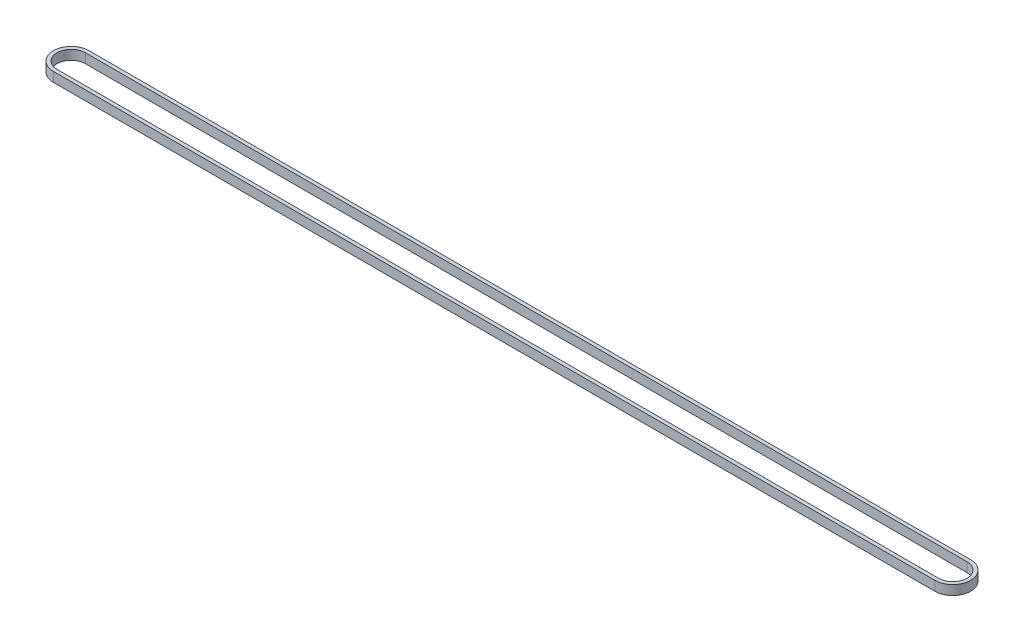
from build123d import *

# Parameters (mm, degrees)
EXTRUDE_2_DEPTH = 4


with BuildPart() as part:
    # Sketch 2 → Extrude 2 (new body)
    with BuildSketch(Plane(origin=(0, 0, 0), x_dir=(1, 0, 0), z_dir=(0, 1, 0))):
        with BuildLine():
            Line((0, 7.5), (370, 7.5))
            ThreePointArc((370, 7.5), (377.5, 0), (370, -7.5))
            Line((370, -7.5), (0, -7.5))
            ThreePointArc((0, -7.5), (-7.5, 0), (0, 7.5))
        make_face()
        with BuildLine():
            Line((0, 6), (370, 6))
            ThreePointArc((370, 6), (376, 0), (370, -6))
            Line((370, -6), (0, -6))
            ThreePointArc((0, -6), (-6, 0), (0, 6))
        make_face(mode=Mode.SUBTRACT)
    extrude(amount=EXTRUDE_2_DEPTH)


solid = part.part
